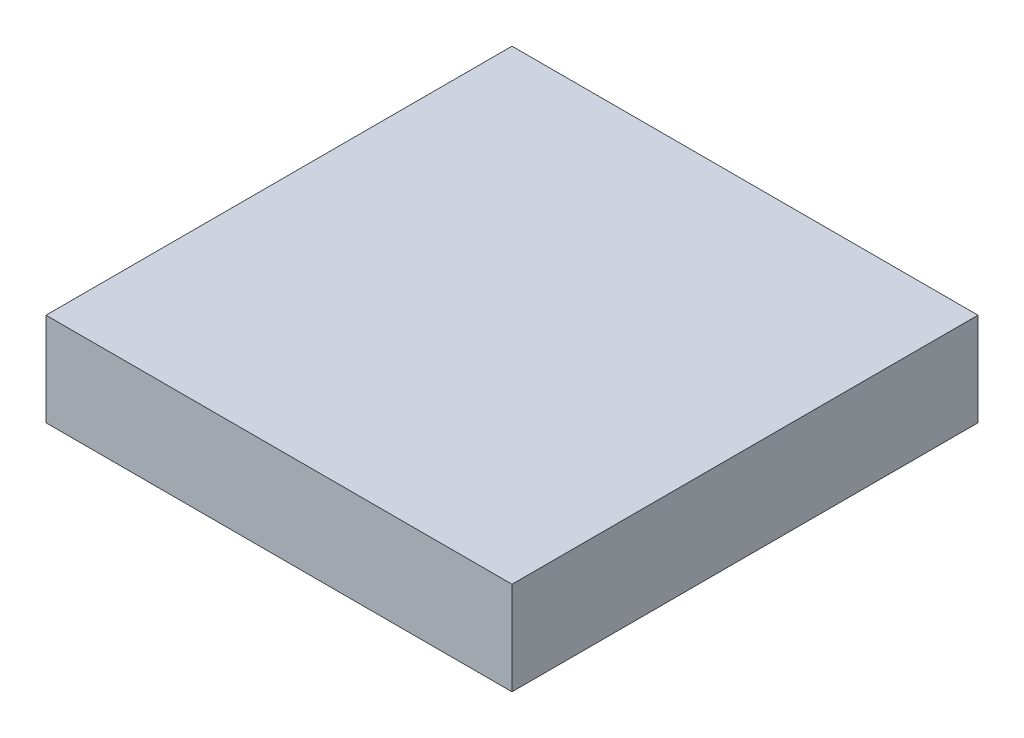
from build123d import *

# Parameters (mm, degrees)
SKETCH1_W           = 150
SKETCH1_H           = 150
BOSS_EXTRUDE1_DEPTH = 30


with BuildPart() as part:
    # Sketch1 → Boss-Extrude1 (new body)
    with BuildSketch(Plane(origin=(0, 0, 0), x_dir=(1, 0, 0), z_dir=(0, 1, 0))):
        Rectangle(SKETCH1_W, SKETCH1_H)
    extrude(amount=BOSS_EXTRUDE1_DEPTH)


solid = part.part
